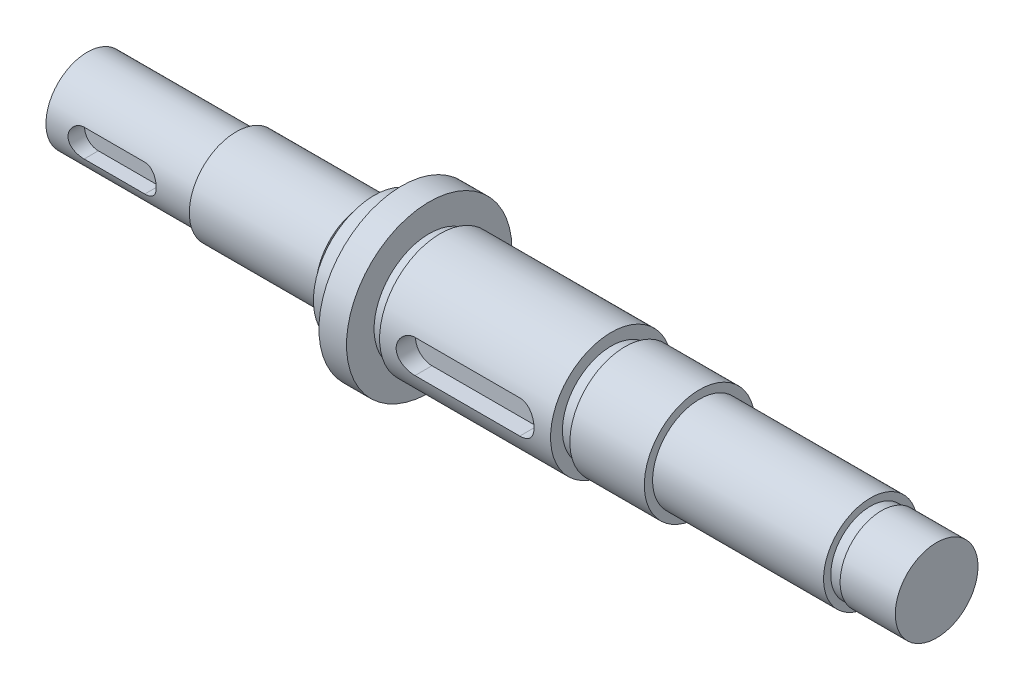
from build123d import *

# Parameters (mm, degrees)
SKETCH_4_R          = 7.5
EXTRUDE_1_DEPTH     = 27
SKETCH_7_R          = 8.5
EXTRUDE_2_DEPTH     = 23
SKETCH_8_R          = 8.2
EXTRUDE_3_DEPTH     = 2
SKETCH_9_R          = 11
EXTRUDE_4_DEPTH     = 5
SKETCH_10_R         = 15
EXTRUDE_5_DEPTH     = 5
SKETCH_11_R         = 10
EXTRUDE_6_DEPTH     = 2
SKETCH_12_R         = 11
EXTRUDE_7_DEPTH     = 31
SKETCH_13_R         = 8.85
EXTRUDE_8_DEPTH     = 2.5
SKETCH_14_R         = 10
EXTRUDE_9_DEPTH     = 13.5
SKETCH_15_R         = 8.5
EXTRUDE_10_DEPTH    = 31
SKETCH_16_R         = 7.2
EXTRUDE_11_DEPTH    = 2
SKETCH_17_R         = 7.5
EXTRUDE_12_DEPTH    = 10
CUT_EXTRUDE_1_DEPTH = 3
CUT_EXTRUDE_2_DEPTH = 3.5


with BuildPart() as part:
    # Sketch 4 → Extrude 1 (new body)
    with BuildSketch(Plane(origin=(0, 0, 0), x_dir=(0, 0, -1), z_dir=(1, 0, 0))):
        Circle(SKETCH_4_R)
    extrude(amount=EXTRUDE_1_DEPTH)

    # Sketch 7 → Extrude 2 (add)
    with BuildSketch(Plane(origin=(27, 0, 0), x_dir=(0, 0, -1), z_dir=(1, 0, 0))):
        Circle(SKETCH_7_R)
    extrude(amount=EXTRUDE_2_DEPTH)

    # Sketch 8 → Extrude 3 (add)
    with BuildSketch(Plane(origin=(50, 0, 0), x_dir=(0, 0, -1), z_dir=(1, 0, 0))):
        Circle(SKETCH_8_R)
    extrude(amount=EXTRUDE_3_DEPTH)

    # Sketch 9 → Extrude 4 (add)
    with BuildSketch(Plane(origin=(52, 0, 0), x_dir=(0, 0, -1), z_dir=(1, 0, 0))):
        Circle(SKETCH_9_R)
    extrude(amount=EXTRUDE_4_DEPTH)

    # Sketch 10 → Extrude 5 (add)
    with BuildSketch(Plane(origin=(57, 0, 0), x_dir=(0, 0, -1), z_dir=(1, 0, 0))):
        Circle(SKETCH_10_R)
    extrude(amount=EXTRUDE_5_DEPTH)

    # Sketch 11 → Extrude 6 (add)
    with BuildSketch(Plane(origin=(62, 0, 0), x_dir=(0, 0, -1), z_dir=(1, 0, 0))):
        Circle(SKETCH_11_R)
    extrude(amount=EXTRUDE_6_DEPTH)

    # Sketch 12 → Extrude 7 (add)
    with BuildSketch(Plane(origin=(64, 0, 0), x_dir=(0, 0, -1), z_dir=(1, 0, 0))):
        Circle(SKETCH_12_R)
    extrude(amount=EXTRUDE_7_DEPTH)

    # Sketch 13 → Extrude 8 (add)
    with BuildSketch(Plane(origin=(95, 0, 0), x_dir=(0, 0, -1), z_dir=(1, 0, 0))):
        Circle(SKETCH_13_R)
    extrude(amount=EXTRUDE_8_DEPTH)

    # Sketch 14 → Extrude 9 (add)
    with BuildSketch(Plane(origin=(97.5, 0, 0), x_dir=(0, 0, -1), z_dir=(1, 0, 0))):
        Circle(SKETCH_14_R)
    extrude(amount=EXTRUDE_9_DEPTH)

    # Sketch 15 → Extrude 10 (add)
    with BuildSketch(Plane(origin=(111, 0, 0), x_dir=(0, 0, -1), z_dir=(1, 0, 0))):
        Circle(SKETCH_15_R)
    extrude(amount=EXTRUDE_10_DEPTH)

    # Sketch 16 → Extrude 11 (add)
    with BuildSketch(Plane(origin=(142, 0, 0), x_dir=(0, 0, -1), z_dir=(1, 0, 0))):
        Circle(SKETCH_16_R)
    extrude(amount=EXTRUDE_11_DEPTH)

    # Sketch 17 → Extrude 12 (add)
    with BuildSketch(Plane(origin=(144, 0, 0), x_dir=(0, 0, -1), z_dir=(1, 0, 0))):
        Circle(SKETCH_17_R)
    extrude(amount=EXTRUDE_12_DEPTH)

    # Sketch 18 → Cut-Extrude 1 (cut)
    with BuildSketch(Plane.XY.offset(7.5)):
        with BuildLine():
            Line((6.5, 2.5), (17.5, 2.5))
            ThreePointArc((17.5, 2.5), (20, 0), (17.5, -2.5))
            Line((17.5, -2.5), (6.5, -2.5))
            ThreePointArc((6.5, -2.5), (4, 0), (6.5, 2.5))
        make_face()
    extrude(amount=-CUT_EXTRUDE_1_DEPTH, mode=Mode.SUBTRACT)

    # Sketch 20 → Cut-Extrude 2 (cut)
    with BuildSketch(Plane.XY.offset(11)):
        with BuildLine():
            Line((70, 3), (89, 3))
            ThreePointArc((89, 3), (92, 0), (89, -3))
            Line((89, -3), (70, -3))
            ThreePointArc((70, -3), (67, 0), (70, 3))
        make_face()
    extrude(amount=-CUT_EXTRUDE_2_DEPTH, mode=Mode.SUBTRACT)


solid = part.part
